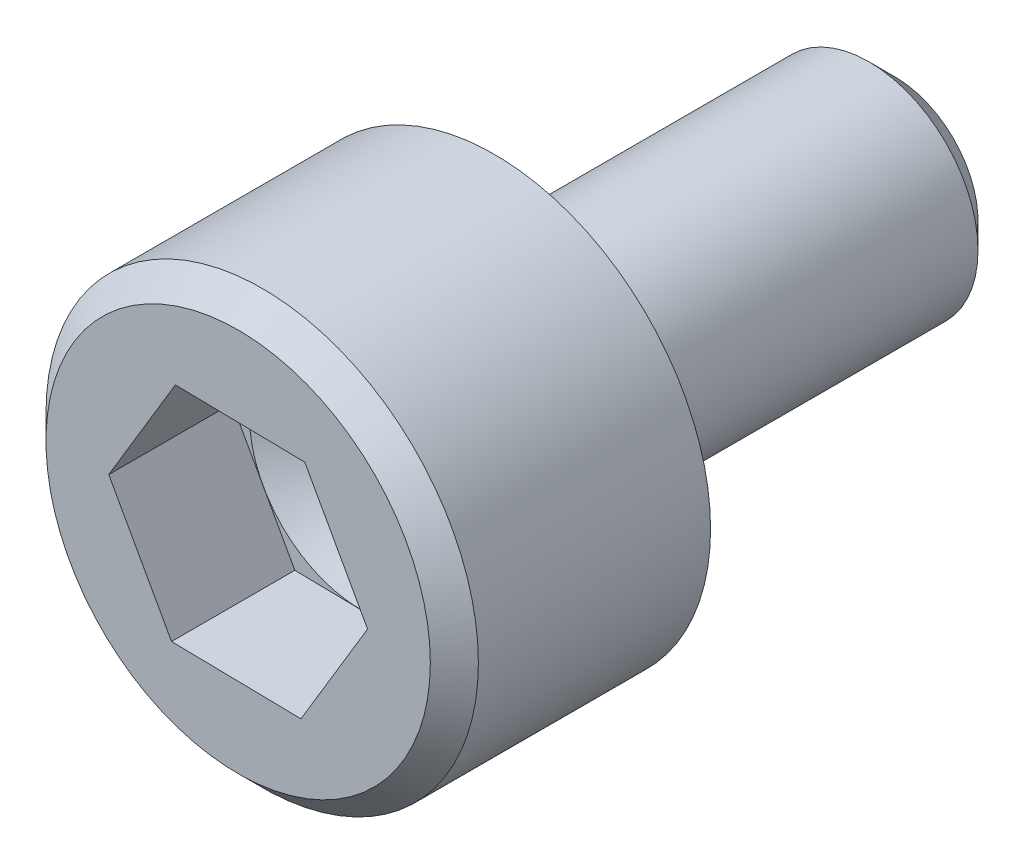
from build123d import *

# Parameters (mm, degrees)
SKETCH1_R           = 3.429
BOSS_EXTRUDE1_DEPTH = 4.064
SKETCH2_R           = 1.7272
BOSS_EXTRUDE2_DEPTH = 6.35
CHAMFER1_SIZE       = 0.381
CHAMFER2_SIZE       = 0.4064
CUT_EXTRUDE1_DEPTH  = 1.9558


with BuildPart() as part:
    # Sketch1 → Boss-Extrude1 (new body)
    with BuildSketch(Plane.XY):
        Circle(SKETCH1_R)
    extrude(amount=-BOSS_EXTRUDE1_DEPTH)

    # Sketch2 → Boss-Extrude2 (add)
    with BuildSketch(Plane(origin=(0, 0, -4.064), x_dir=(-1, 0, 0), z_dir=(0, 0, -1))):
        with Locations(Location((0, 0, 0), (0, 0, 180))):
            Circle(SKETCH2_R)
    extrude(amount=BOSS_EXTRUDE2_DEPTH)

    # Chamfer1
    chamfer1_edges = [part.edges().sort_by_distance(p)[0] for p in [
        (-3.429, 0, 0),
    ]]
    chamfer(chamfer1_edges, length=CHAMFER1_SIZE)

    # Chamfer2
    chamfer2_edges = [part.edges().sort_by_distance(p)[0] for p in [
        (-1.7272, 0, -10.414),
    ]]
    chamfer(chamfer2_edges, length=CHAMFER2_SIZE)

    # Sketch3 → Cut-Extrude1 (cut)
    with BuildSketch(Plane.XY):
        Polygon((1.056732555, 1.760216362), (-0.996025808, 1.795265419), (-2.052758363, 0.035049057), (-1.056732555, -1.760216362), (0.996025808, -1.795265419), (2.052758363, -0.035049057), align=None)
    extrude(amount=-CUT_EXTRUDE1_DEPTH, mode=Mode.SUBTRACT)

    # Sketch4 → Cut-Revolve1 (revolve, cut)
    with BuildSketch(Plane(origin=(0, 0, 0), x_dir=(0, 0, -1), z_dir=(1, 0, 0)), mode=Mode.PRIVATE) as cut_revolve1_sk:
        Polygon((1.9558, 1.77774089), (2.9718, 0), (1.9558, 0), align=None)
    revolve(cut_revolve1_sk.sketch.rotate(Axis((0, 0, -2.9718), (0, 0, 1)), 90), axis=Axis((0, 0, -2.9718), (0, 0, 1)), mode=Mode.SUBTRACT)


solid = part.part
